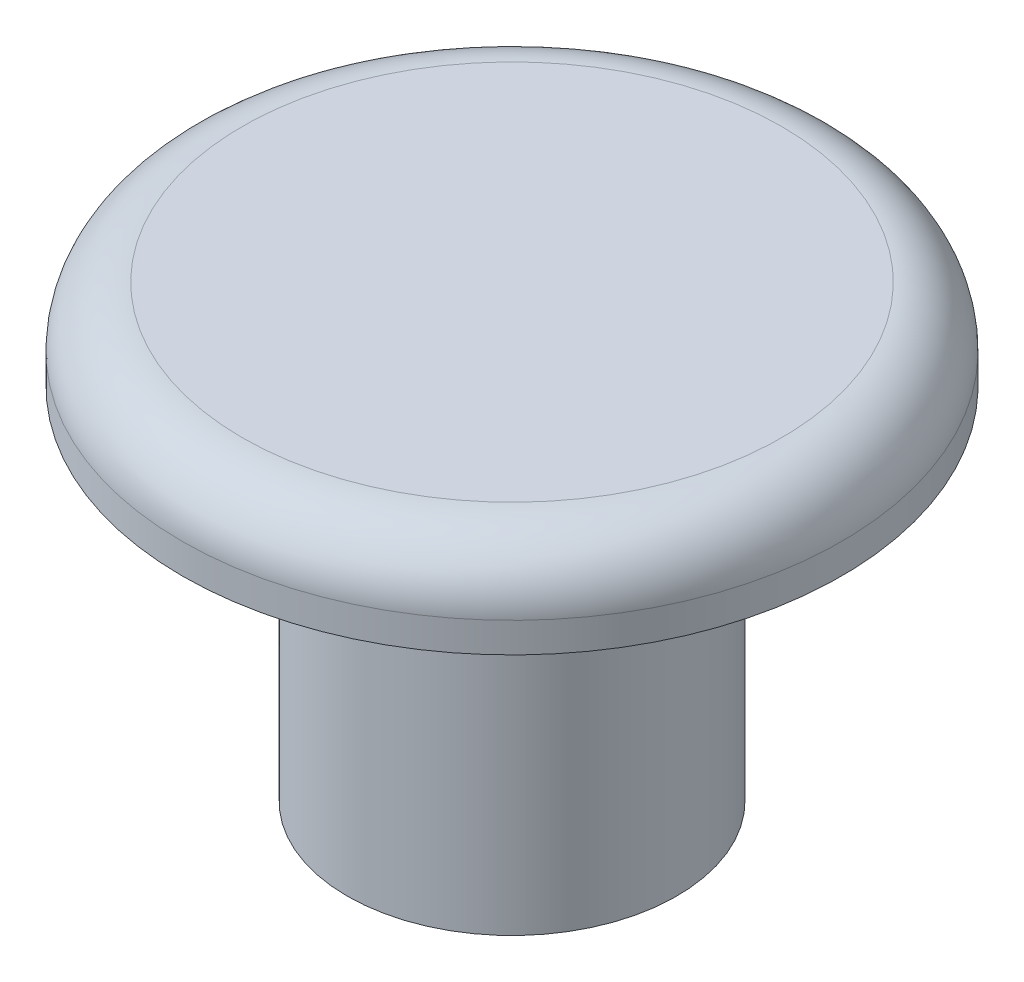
from build123d import *


with BuildPart() as part:
    # Sketch2 → Revolve1 (revolve)
    with BuildSketch(Plane.XY, mode=Mode.PRIVATE) as revolve1_sk:
        with BuildLine():
            Line((0, 0), (9, 0))
            ThreePointArc((9, 0), (10.414213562, -0.585786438), (11, -2))
            Line((11, -2), (11, -3))
            Line((11, -3), (5.5, -3))
            Line((5.5, -3), (5.5, -15))
            Line((5.5, -15), (0, -15))
            Line((0, -15), (0, 0))
        make_face()
    revolve(revolve1_sk.sketch.rotate(Axis((0, 0, 0), (0, -1, 0)), 90), axis=Axis((0, 0, 0), (0, -1, 0)))


solid = part.part
